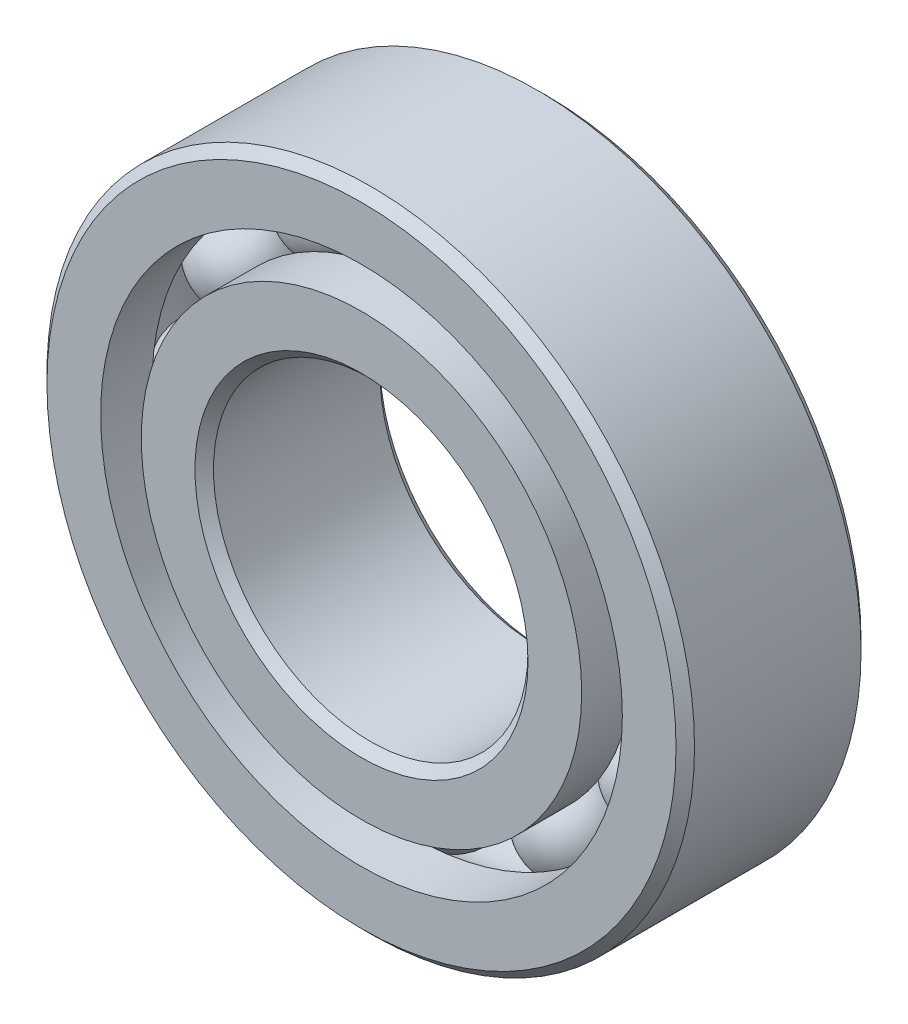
ISO-10303-21;
HEADER;
FILE_DESCRIPTION(('STEP AP214'),'2;1');
FILE_NAME('part.step','',(''),(''),'','','');
FILE_SCHEMA(('AUTOMOTIVE_DESIGN { 1 0 10303 214 1 1 1 1 }'));
ENDSEC;
DATA;
#1=APPLICATION_CONTEXT('core data for automotive mechanical design processes');
#2=APPLICATION_PROTOCOL_DEFINITION('international standard','automotive_design',2000,#1);
#3=PRODUCT_CONTEXT('',#1,'mechanical');
#4=PRODUCT('Part','Part','',(#3));
#5=PRODUCT_RELATED_PRODUCT_CATEGORY('part','',(#4));
#6=PRODUCT_DEFINITION_FORMATION('','',#4);
#7=PRODUCT_DEFINITION_CONTEXT('part definition',#1,'design');
#8=PRODUCT_DEFINITION('design','',#6,#7);
#9=PRODUCT_DEFINITION_SHAPE('','',#8);
#10=(LENGTH_UNIT() NAMED_UNIT(*) SI_UNIT(.MILLI.,.METRE.));
#11=(NAMED_UNIT(*) PLANE_ANGLE_UNIT() SI_UNIT($,.RADIAN.));
#12=(NAMED_UNIT(*) SI_UNIT($,.STERADIAN.) SOLID_ANGLE_UNIT());
#13=UNCERTAINTY_MEASURE_WITH_UNIT(LENGTH_MEASURE(1.E-05),#10,'distance_accuracy_value','');
#14=(GEOMETRIC_REPRESENTATION_CONTEXT(3) GLOBAL_UNCERTAINTY_ASSIGNED_CONTEXT((#13)) GLOBAL_UNIT_ASSIGNED_CONTEXT((#10,
#11,#12)) REPRESENTATION_CONTEXT('',''));
#15=CARTESIAN_POINT('',(0.,0.,0.));
#16=DIRECTION('',(0.,0.,1.));
#17=DIRECTION('',(1.,0.,0.));
#18=AXIS2_PLACEMENT_3D('',#15,#16,#17);
#19=CARTESIAN_POINT('',(-6.49999999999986,11.2583302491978,0.));
#20=DIRECTION('',(0.,0.,1.));
#21=DIRECTION('',(-0.499999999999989,0.866025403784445,0.));
#22=AXIS2_PLACEMENT_3D('',#19,#20,#21);
#23=SPHERICAL_SURFACE('',#22,2.47908354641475);
#24=CARTESIAN_POINT('',(-6.49999999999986,11.2583302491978,2.47908354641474));
#25=VERTEX_POINT('',#24);
#26=VERTEX_LOOP('',#25);
#27=FACE_BOUND('',#26,.T.);
#28=ADVANCED_FACE('F37',(#27),#23,.T.);
#29=CLOSED_SHELL('',(#28));
#30=MANIFOLD_SOLID_BREP('B2',#29);
#31=CARTESIAN_POINT('',(-11.2583302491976,6.50000000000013,0.));
#32=DIRECTION('',(0.,0.,1.));
#33=DIRECTION('',(-0.866025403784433,0.50000000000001,0.));
#34=AXIS2_PLACEMENT_3D('',#31,#32,#33);
#35=SPHERICAL_SURFACE('',#34,2.47908354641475);
#36=CARTESIAN_POINT('',(-11.2583302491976,6.50000000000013,2.47908354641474));
#37=VERTEX_POINT('',#36);
#38=VERTEX_LOOP('',#37);
#39=FACE_BOUND('',#38,.T.);
#40=ADVANCED_FACE('F57',(#39),#35,.T.);
#41=CLOSED_SHELL('',(#40));
#42=MANIFOLD_SOLID_BREP('B6',#41);
#43=CARTESIAN_POINT('',(-13.,1.36167772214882E-13,0.));
#44=DIRECTION('',(0.,0.,1.));
#45=DIRECTION('',(-1.,0.,0.));
#46=AXIS2_PLACEMENT_3D('',#43,#44,#45);
#47=SPHERICAL_SURFACE('',#46,2.47908354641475);
#48=CARTESIAN_POINT('',(-13.,1.36167772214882E-13,2.47908354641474));
#49=VERTEX_POINT('',#48);
#50=VERTEX_LOOP('',#49);
#51=FACE_BOUND('',#50,.T.);
#52=ADVANCED_FACE('F77',(#51),#47,.T.);
#53=CLOSED_SHELL('',(#52));
#54=MANIFOLD_SOLID_BREP('B33',#53);
#55=CARTESIAN_POINT('',(-11.2583302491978,-6.4999999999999,0.));
#56=DIRECTION('',(0.,0.,1.));
#57=DIRECTION('',(-0.866025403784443,-0.499999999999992,0.));
#58=AXIS2_PLACEMENT_3D('',#55,#56,#57);
#59=SPHERICAL_SURFACE('',#58,2.47908354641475);
#60=CARTESIAN_POINT('',(-11.2583302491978,-6.4999999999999,2.47908354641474));
#61=VERTEX_POINT('',#60);
#62=VERTEX_LOOP('',#61);
#63=FACE_BOUND('',#62,.T.);
#64=ADVANCED_FACE('F97',(#63),#59,.T.);
#65=CLOSED_SHELL('',(#64));
#66=MANIFOLD_SOLID_BREP('B53',#65);
#67=CARTESIAN_POINT('',(-6.50000000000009,-11.2583302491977,0.));
#68=DIRECTION('',(0.,0.,1.));
#69=DIRECTION('',(-0.500000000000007,-0.866025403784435,0.));
#70=AXIS2_PLACEMENT_3D('',#67,#68,#69);
#71=SPHERICAL_SURFACE('',#70,2.47908354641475);
#72=CARTESIAN_POINT('',(-6.50000000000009,-11.2583302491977,2.47908354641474));
#73=VERTEX_POINT('',#72);
#74=VERTEX_LOOP('',#73);
#75=FACE_BOUND('',#74,.T.);
#76=ADVANCED_FACE('F117',(#75),#71,.T.);
#77=CLOSED_SHELL('',(#76));
#78=MANIFOLD_SOLID_BREP('B73',#77);
#79=CARTESIAN_POINT('',(0.,-13.,0.));
#80=DIRECTION('',(0.,0.,1.));
#81=DIRECTION('',(0.,-1.,0.));
#82=AXIS2_PLACEMENT_3D('',#79,#80,#81);
#83=SPHERICAL_SURFACE('',#82,2.47908354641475);
#84=CARTESIAN_POINT('',(0.,-13.,2.47908354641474));
#85=VERTEX_POINT('',#84);
#86=VERTEX_LOOP('',#85);
#87=FACE_BOUND('',#86,.T.);
#88=ADVANCED_FACE('F137',(#87),#83,.T.);
#89=CLOSED_SHELL('',(#88));
#90=MANIFOLD_SOLID_BREP('B93',#89);
#91=CARTESIAN_POINT('',(6.49999999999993,-11.2583302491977,0.));
#92=DIRECTION('',(0.,0.,1.));
#93=DIRECTION('',(0.499999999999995,-0.866025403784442,0.));
#94=AXIS2_PLACEMENT_3D('',#91,#92,#93);
#95=SPHERICAL_SURFACE('',#94,2.47908354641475);
#96=CARTESIAN_POINT('',(6.49999999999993,-11.2583302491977,2.47908354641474));
#97=VERTEX_POINT('',#96);
#98=VERTEX_LOOP('',#97);
#99=FACE_BOUND('',#98,.T.);
#100=ADVANCED_FACE('F157',(#99),#95,.T.);
#101=CLOSED_SHELL('',(#100));
#102=MANIFOLD_SOLID_BREP('B113',#101);
#103=CARTESIAN_POINT('',(11.2583302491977,-6.50000000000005,0.));
#104=DIRECTION('',(0.,0.,1.));
#105=DIRECTION('',(0.866025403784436,-0.500000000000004,0.));
#106=AXIS2_PLACEMENT_3D('',#103,#104,#105);
#107=SPHERICAL_SURFACE('',#106,2.47908354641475);
#108=CARTESIAN_POINT('',(11.2583302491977,-6.50000000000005,2.47908354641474));
#109=VERTEX_POINT('',#108);
#110=VERTEX_LOOP('',#109);
#111=FACE_BOUND('',#110,.T.);
#112=ADVANCED_FACE('F177',(#111),#107,.T.);
#113=CLOSED_SHELL('',(#112));
#114=MANIFOLD_SOLID_BREP('B133',#113);
#115=CARTESIAN_POINT('',(13.,0.,0.));
#116=DIRECTION('',(0.,0.,1.));
#117=DIRECTION('',(1.,0.,0.));
#118=AXIS2_PLACEMENT_3D('',#115,#116,#117);
#119=SPHERICAL_SURFACE('',#118,2.47908354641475);
#120=CARTESIAN_POINT('',(13.,0.,2.47908354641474));
#121=VERTEX_POINT('',#120);
#122=VERTEX_LOOP('',#121);
#123=FACE_BOUND('',#122,.T.);
#124=ADVANCED_FACE('F197',(#123),#119,.T.);
#125=CLOSED_SHELL('',(#124));
#126=MANIFOLD_SOLID_BREP('B153',#125);
#127=CARTESIAN_POINT('',(11.2583302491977,6.49999999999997,0.));
#128=DIRECTION('',(0.,0.,1.));
#129=DIRECTION('',(0.86602540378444,0.499999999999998,0.));
#130=AXIS2_PLACEMENT_3D('',#127,#128,#129);
#131=SPHERICAL_SURFACE('',#130,2.47908354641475);
#132=CARTESIAN_POINT('',(11.2583302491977,6.49999999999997,2.47908354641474));
#133=VERTEX_POINT('',#132);
#134=VERTEX_LOOP('',#133);
#135=FACE_BOUND('',#134,.T.);
#136=ADVANCED_FACE('F217',(#135),#131,.T.);
#137=CLOSED_SHELL('',(#136));
#138=MANIFOLD_SOLID_BREP('B173',#137);
#139=CARTESIAN_POINT('',(6.50000000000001,11.2583302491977,0.));
#140=DIRECTION('',(0.,0.,1.));
#141=DIRECTION('',(0.500000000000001,0.866025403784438,0.));
#142=AXIS2_PLACEMENT_3D('',#139,#140,#141);
#143=SPHERICAL_SURFACE('',#142,2.47908354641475);
#144=CARTESIAN_POINT('',(6.50000000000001,11.2583302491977,2.47908354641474));
#145=VERTEX_POINT('',#144);
#146=VERTEX_LOOP('',#145);
#147=FACE_BOUND('',#146,.T.);
#148=ADVANCED_FACE('F237',(#147),#143,.T.);
#149=CLOSED_SHELL('',(#148));
#150=MANIFOLD_SOLID_BREP('B193',#149);
#151=CARTESIAN_POINT('',(0.,13.,0.));
#152=DIRECTION('',(0.,0.,1.));
#153=DIRECTION('',(0.,1.,0.));
#154=AXIS2_PLACEMENT_3D('',#151,#152,#153);
#155=SPHERICAL_SURFACE('',#154,2.47908354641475);
#156=CARTESIAN_POINT('',(0.,13.,2.47908354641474));
#157=VERTEX_POINT('',#156);
#158=VERTEX_LOOP('',#157);
#159=FACE_BOUND('',#158,.T.);
#160=ADVANCED_FACE('F259',(#159),#155,.T.);
#161=CLOSED_SHELL('',(#160));
#162=MANIFOLD_SOLID_BREP('B213',#161);
#163=CARTESIAN_POINT('',(0.,11.9010989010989,5.));
#164=DIRECTION('',(0.,0.,-1.));
#165=DIRECTION('',(-1.,0.,0.));
#166=AXIS2_PLACEMENT_3D('',#163,#164,#165);
#167=PLANE('',#166);
#168=CARTESIAN_POINT('',(0.,0.,5.));
#169=DIRECTION('',(0.,0.,1.));
#170=DIRECTION('',(1.,0.,0.));
#171=AXIS2_PLACEMENT_3D('',#168,#169,#170);
#172=CIRCLE('',#171,9.);
#173=CARTESIAN_POINT('',(9.,0.,5.));
#174=VERTEX_POINT('',#173);
#175=EDGE_CURVE('E306',#174,#174,#172,.T.);
#176=ORIENTED_EDGE('',*,*,#175,.F.);
#177=EDGE_LOOP('',(#176));
#178=FACE_BOUND('',#177,.T.);
#179=CARTESIAN_POINT('',(0.,0.,5.));
#180=DIRECTION('',(0.,0.,1.));
#181=DIRECTION('',(1.,0.,0.));
#182=AXIS2_PLACEMENT_3D('',#179,#180,#181);
#183=CIRCLE('',#182,11.9010989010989);
#184=CARTESIAN_POINT('',(11.9010989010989,0.,5.));
#185=VERTEX_POINT('',#184);
#186=EDGE_CURVE('E258',#185,#185,#183,.T.);
#187=ORIENTED_EDGE('',*,*,#186,.T.);
#188=EDGE_LOOP('',(#187));
#189=FACE_BOUND('',#188,.T.);
#190=ADVANCED_FACE('F278',(#178,#189),#167,.F.);
#191=CARTESIAN_POINT('',(0.,0.,5.));
#192=DIRECTION('',(0.,0.,1.));
#193=DIRECTION('',(1.,0.,0.));
#194=AXIS2_PLACEMENT_3D('',#191,#192,#193);
#195=CYLINDRICAL_SURFACE('',#194,11.9010989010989);
#196=ORIENTED_EDGE('',*,*,#186,.F.);
#197=EDGE_LOOP('',(#196));
#198=FACE_BOUND('',#197,.T.);
#199=CARTESIAN_POINT('',(0.,0.,2.22222222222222));
#200=DIRECTION('',(0.,0.,1.));
#201=DIRECTION('',(1.,0.,0.));
#202=AXIS2_PLACEMENT_3D('',#199,#200,#201);
#203=CIRCLE('',#202,11.9010989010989);
#204=CARTESIAN_POINT('',(11.9010989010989,0.,2.22222222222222));
#205=VERTEX_POINT('',#204);
#206=EDGE_CURVE('E284',#205,#205,#203,.T.);
#207=ORIENTED_EDGE('',*,*,#206,.T.);
#208=EDGE_LOOP('',(#207));
#209=FACE_BOUND('',#208,.T.);
#210=ADVANCED_FACE('F313',(#198,#209),#195,.T.);
#211=CARTESIAN_POINT('',(0.,0.,0.));
#212=DIRECTION('',(0.,0.,1.));
#213=DIRECTION('',(1.,0.,0.));
#214=AXIS2_PLACEMENT_3D('',#211,#212,#213);
#215=TOROIDAL_SURFACE('',#214,13.,2.47908354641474);
#216=ORIENTED_EDGE('',*,*,#206,.F.);
#217=EDGE_LOOP('',(#216));
#218=FACE_BOUND('',#217,.T.);
#219=CARTESIAN_POINT('',(0.,0.,-2.22222222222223));
#220=DIRECTION('',(0.,0.,1.));
#221=DIRECTION('',(1.,0.,0.));
#222=AXIS2_PLACEMENT_3D('',#219,#220,#221);
#223=CIRCLE('',#222,11.9010989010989);
#224=CARTESIAN_POINT('',(11.9010989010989,0.,-2.22222222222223));
#225=VERTEX_POINT('',#224);
#226=EDGE_CURVE('E288',#225,#225,#223,.T.);
#227=ORIENTED_EDGE('',*,*,#226,.T.);
#228=EDGE_LOOP('',(#227));
#229=FACE_BOUND('',#228,.T.);
#230=ADVANCED_FACE('F317',(#218,#229),#215,.F.);
#231=CARTESIAN_POINT('',(0.,0.,5.));
#232=DIRECTION('',(0.,0.,1.));
#233=DIRECTION('',(1.,0.,0.));
#234=AXIS2_PLACEMENT_3D('',#231,#232,#233);
#235=CYLINDRICAL_SURFACE('',#234,11.9010989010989);
#236=ORIENTED_EDGE('',*,*,#226,.F.);
#237=EDGE_LOOP('',(#236));
#238=FACE_BOUND('',#237,.T.);
#239=CARTESIAN_POINT('',(0.,0.,-5.));
#240=DIRECTION('',(0.,0.,1.));
#241=DIRECTION('',(1.,0.,0.));
#242=AXIS2_PLACEMENT_3D('',#239,#240,#241);
#243=CIRCLE('',#242,11.9010989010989);
#244=CARTESIAN_POINT('',(11.9010989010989,0.,-5.));
#245=VERTEX_POINT('',#244);
#246=EDGE_CURVE('E292',#245,#245,#243,.T.);
#247=ORIENTED_EDGE('',*,*,#246,.T.);
#248=EDGE_LOOP('',(#247));
#249=FACE_BOUND('',#248,.T.);
#250=ADVANCED_FACE('F322',(#238,#249),#235,.T.);
#251=CARTESIAN_POINT('',(0.,9.,-5.));
#252=DIRECTION('',(0.,0.,1.));
#253=DIRECTION('',(1.,0.,0.));
#254=AXIS2_PLACEMENT_3D('',#251,#252,#253);
#255=PLANE('',#254);
#256=ORIENTED_EDGE('',*,*,#246,.F.);
#257=EDGE_LOOP('',(#256));
#258=FACE_BOUND('',#257,.T.);
#259=CARTESIAN_POINT('',(0.,0.,-5.));
#260=DIRECTION('',(0.,0.,1.));
#261=DIRECTION('',(1.,0.,0.));
#262=AXIS2_PLACEMENT_3D('',#259,#260,#261);
#263=CIRCLE('',#262,9.);
#264=CARTESIAN_POINT('',(9.,0.,-5.));
#265=VERTEX_POINT('',#264);
#266=EDGE_CURVE('E297',#265,#265,#263,.T.);
#267=ORIENTED_EDGE('',*,*,#266,.T.);
#268=EDGE_LOOP('',(#267));
#269=FACE_BOUND('',#268,.T.);
#270=ADVANCED_FACE('F328',(#258,#269),#255,.F.);
#271=CARTESIAN_POINT('',(0.,0.,-4.5));
#272=DIRECTION('',(0.,0.,-1.));
#273=DIRECTION('',(-1.,0.,0.));
#274=AXIS2_PLACEMENT_3D('',#271,#272,#273);
#275=CONICAL_SURFACE('',#274,8.5,0.785398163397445);
#276=ORIENTED_EDGE('',*,*,#266,.F.);
#277=EDGE_LOOP('',(#276));
#278=FACE_BOUND('',#277,.T.);
#279=CARTESIAN_POINT('',(0.,0.,-4.5));
#280=DIRECTION('',(0.,0.,1.));
#281=DIRECTION('',(1.,0.,0.));
#282=AXIS2_PLACEMENT_3D('',#279,#280,#281);
#283=CIRCLE('',#282,8.5);
#284=CARTESIAN_POINT('',(8.5,0.,-4.5));
#285=VERTEX_POINT('',#284);
#286=EDGE_CURVE('E300',#285,#285,#283,.T.);
#287=ORIENTED_EDGE('',*,*,#286,.T.);
#288=EDGE_LOOP('',(#287));
#289=FACE_BOUND('',#288,.T.);
#290=ADVANCED_FACE('F332',(#278,#289),#275,.F.);
#291=CARTESIAN_POINT('',(0.,0.,5.));
#292=DIRECTION('',(0.,0.,1.));
#293=DIRECTION('',(1.,0.,0.));
#294=AXIS2_PLACEMENT_3D('',#291,#292,#293);
#295=CYLINDRICAL_SURFACE('',#294,8.5);
#296=ORIENTED_EDGE('',*,*,#286,.F.);
#297=EDGE_LOOP('',(#296));
#298=FACE_BOUND('',#297,.T.);
#299=CARTESIAN_POINT('',(0.,0.,4.50000000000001));
#300=DIRECTION('',(0.,0.,1.));
#301=DIRECTION('',(1.,0.,0.));
#302=AXIS2_PLACEMENT_3D('',#299,#300,#301);
#303=CIRCLE('',#302,8.5);
#304=CARTESIAN_POINT('',(8.5,0.,4.50000000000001));
#305=VERTEX_POINT('',#304);
#306=EDGE_CURVE('E303',#305,#305,#303,.T.);
#307=ORIENTED_EDGE('',*,*,#306,.T.);
#308=EDGE_LOOP('',(#307));
#309=FACE_BOUND('',#308,.T.);
#310=ADVANCED_FACE('F336',(#298,#309),#295,.F.);
#311=CARTESIAN_POINT('',(0.,0.,5.));
#312=DIRECTION('',(0.,0.,1.));
#313=DIRECTION('',(1.,0.,0.));
#314=AXIS2_PLACEMENT_3D('',#311,#312,#313);
#315=CONICAL_SURFACE('',#314,9.,0.785398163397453);
#316=ORIENTED_EDGE('',*,*,#306,.F.);
#317=EDGE_LOOP('',(#316));
#318=FACE_BOUND('',#317,.T.);
#319=ORIENTED_EDGE('',*,*,#175,.T.);
#320=EDGE_LOOP('',(#319));
#321=FACE_BOUND('',#320,.T.);
#322=ADVANCED_FACE('F310',(#318,#321),#315,.F.);
#323=CLOSED_SHELL('',(#190,#210,#230,#250,#270,#290,#310,#322));
#324=MANIFOLD_SOLID_BREP('B233',#323);
#325=CARTESIAN_POINT('',(0.,0.,4.5));
#326=DIRECTION('',(0.,0.,-1.));
#327=DIRECTION('',(-1.,0.,0.));
#328=AXIS2_PLACEMENT_3D('',#325,#326,#327);
#329=CONICAL_SURFACE('',#328,17.5,0.785398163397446);
#330=CARTESIAN_POINT('',(0.,0.,5.));
#331=DIRECTION('',(0.,0.,1.));
#332=DIRECTION('',(1.,0.,0.));
#333=AXIS2_PLACEMENT_3D('',#330,#331,#332);
#334=CIRCLE('',#333,17.);
#335=CARTESIAN_POINT('',(17.,0.,5.));
#336=VERTEX_POINT('',#335);
#337=EDGE_CURVE('E427',#336,#336,#334,.T.);
#338=ORIENTED_EDGE('',*,*,#337,.F.);
#339=EDGE_LOOP('',(#338));
#340=FACE_BOUND('',#339,.T.);
#341=CARTESIAN_POINT('',(0.,0.,4.5));
#342=DIRECTION('',(0.,0.,1.));
#343=DIRECTION('',(1.,0.,0.));
#344=AXIS2_PLACEMENT_3D('',#341,#342,#343);
#345=CIRCLE('',#344,17.5);
#346=CARTESIAN_POINT('',(17.5,0.,4.5));
#347=VERTEX_POINT('',#346);
#348=EDGE_CURVE('E277',#347,#347,#345,.T.);
#349=ORIENTED_EDGE('',*,*,#348,.T.);
#350=EDGE_LOOP('',(#349));
#351=FACE_BOUND('',#350,.T.);
#352=ADVANCED_FACE('F399',(#340,#351),#329,.T.);
#353=CARTESIAN_POINT('',(0.,0.,5.));
#354=DIRECTION('',(0.,0.,1.));
#355=DIRECTION('',(1.,0.,0.));
#356=AXIS2_PLACEMENT_3D('',#353,#354,#355);
#357=CYLINDRICAL_SURFACE('',#356,17.5);
#358=ORIENTED_EDGE('',*,*,#348,.F.);
#359=EDGE_LOOP('',(#358));
#360=FACE_BOUND('',#359,.T.);
#361=CARTESIAN_POINT('',(0.,0.,-4.5));
#362=DIRECTION('',(0.,0.,1.));
#363=DIRECTION('',(1.,0.,0.));
#364=AXIS2_PLACEMENT_3D('',#361,#362,#363);
#365=CIRCLE('',#364,17.5);
#366=CARTESIAN_POINT('',(17.5,0.,-4.5));
#367=VERTEX_POINT('',#366);
#368=EDGE_CURVE('E405',#367,#367,#365,.T.);
#369=ORIENTED_EDGE('',*,*,#368,.T.);
#370=EDGE_LOOP('',(#369));
#371=FACE_BOUND('',#370,.T.);
#372=ADVANCED_FACE('F434',(#360,#371),#357,.T.);
#373=CARTESIAN_POINT('',(0.,0.,-5.));
#374=DIRECTION('',(0.,0.,1.));
#375=DIRECTION('',(1.,0.,0.));
#376=AXIS2_PLACEMENT_3D('',#373,#374,#375);
#377=CONICAL_SURFACE('',#376,17.,0.785398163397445);
#378=ORIENTED_EDGE('',*,*,#368,.F.);
#379=EDGE_LOOP('',(#378));
#380=FACE_BOUND('',#379,.T.);
#381=CARTESIAN_POINT('',(0.,0.,-5.));
#382=DIRECTION('',(0.,0.,1.));
#383=DIRECTION('',(1.,0.,0.));
#384=AXIS2_PLACEMENT_3D('',#381,#382,#383);
#385=CIRCLE('',#384,17.);
#386=CARTESIAN_POINT('',(17.,0.,-5.));
#387=VERTEX_POINT('',#386);
#388=EDGE_CURVE('E409',#387,#387,#385,.T.);
#389=ORIENTED_EDGE('',*,*,#388,.T.);
#390=EDGE_LOOP('',(#389));
#391=FACE_BOUND('',#390,.T.);
#392=ADVANCED_FACE('F438',(#380,#391),#377,.T.);
#393=CARTESIAN_POINT('',(0.,17.,-5.));
#394=DIRECTION('',(0.,0.,1.));
#395=DIRECTION('',(1.,0.,0.));
#396=AXIS2_PLACEMENT_3D('',#393,#394,#395);
#397=PLANE('',#396);
#398=ORIENTED_EDGE('',*,*,#388,.F.);
#399=EDGE_LOOP('',(#398));
#400=FACE_BOUND('',#399,.T.);
#401=CARTESIAN_POINT('',(0.,0.,-5.));
#402=DIRECTION('',(0.,0.,1.));
#403=DIRECTION('',(1.,0.,0.));
#404=AXIS2_PLACEMENT_3D('',#401,#402,#403);
#405=CIRCLE('',#404,14.0989010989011);
#406=CARTESIAN_POINT('',(14.0989010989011,0.,-5.));
#407=VERTEX_POINT('',#406);
#408=EDGE_CURVE('E413',#407,#407,#405,.T.);
#409=ORIENTED_EDGE('',*,*,#408,.T.);
#410=EDGE_LOOP('',(#409));
#411=FACE_BOUND('',#410,.T.);
#412=ADVANCED_FACE('F443',(#400,#411),#397,.F.);
#413=CARTESIAN_POINT('',(0.,0.,5.));
#414=DIRECTION('',(0.,0.,1.));
#415=DIRECTION('',(1.,0.,0.));
#416=AXIS2_PLACEMENT_3D('',#413,#414,#415);
#417=CYLINDRICAL_SURFACE('',#416,14.0989010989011);
#418=ORIENTED_EDGE('',*,*,#408,.F.);
#419=EDGE_LOOP('',(#418));
#420=FACE_BOUND('',#419,.T.);
#421=CARTESIAN_POINT('',(0.,0.,-2.22222222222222));
#422=DIRECTION('',(0.,0.,1.));
#423=DIRECTION('',(1.,0.,0.));
#424=AXIS2_PLACEMENT_3D('',#421,#422,#423);
#425=CIRCLE('',#424,14.0989010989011);
#426=CARTESIAN_POINT('',(14.0989010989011,0.,-2.22222222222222));
#427=VERTEX_POINT('',#426);
#428=EDGE_CURVE('E418',#427,#427,#425,.T.);
#429=ORIENTED_EDGE('',*,*,#428,.T.);
#430=EDGE_LOOP('',(#429));
#431=FACE_BOUND('',#430,.T.);
#432=ADVANCED_FACE('F449',(#420,#431),#417,.F.);
#433=CARTESIAN_POINT('',(0.,0.,0.));
#434=DIRECTION('',(0.,0.,1.));
#435=DIRECTION('',(1.,0.,0.));
#436=AXIS2_PLACEMENT_3D('',#433,#434,#435);
#437=TOROIDAL_SURFACE('',#436,13.,2.47908354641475);
#438=ORIENTED_EDGE('',*,*,#428,.F.);
#439=EDGE_LOOP('',(#438));
#440=FACE_BOUND('',#439,.T.);
#441=CARTESIAN_POINT('',(0.,0.,2.22222222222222));
#442=DIRECTION('',(0.,0.,1.));
#443=DIRECTION('',(1.,0.,0.));
#444=AXIS2_PLACEMENT_3D('',#441,#442,#443);
#445=CIRCLE('',#444,14.0989010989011);
#446=CARTESIAN_POINT('',(14.0989010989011,0.,2.22222222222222));
#447=VERTEX_POINT('',#446);
#448=EDGE_CURVE('E421',#447,#447,#445,.T.);
#449=ORIENTED_EDGE('',*,*,#448,.T.);
#450=EDGE_LOOP('',(#449));
#451=FACE_BOUND('',#450,.T.);
#452=ADVANCED_FACE('F453',(#440,#451),#437,.F.);
#453=CARTESIAN_POINT('',(0.,0.,5.));
#454=DIRECTION('',(0.,0.,1.));
#455=DIRECTION('',(1.,0.,0.));
#456=AXIS2_PLACEMENT_3D('',#453,#454,#455);
#457=CYLINDRICAL_SURFACE('',#456,14.0989010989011);
#458=ORIENTED_EDGE('',*,*,#448,.F.);
#459=EDGE_LOOP('',(#458));
#460=FACE_BOUND('',#459,.T.);
#461=CARTESIAN_POINT('',(0.,0.,5.));
#462=DIRECTION('',(0.,0.,1.));
#463=DIRECTION('',(1.,0.,0.));
#464=AXIS2_PLACEMENT_3D('',#461,#462,#463);
#465=CIRCLE('',#464,14.0989010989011);
#466=CARTESIAN_POINT('',(14.0989010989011,0.,5.));
#467=VERTEX_POINT('',#466);
#468=EDGE_CURVE('E424',#467,#467,#465,.T.);
#469=ORIENTED_EDGE('',*,*,#468,.T.);
#470=EDGE_LOOP('',(#469));
#471=FACE_BOUND('',#470,.T.);
#472=ADVANCED_FACE('F457',(#460,#471),#457,.F.);
#473=CARTESIAN_POINT('',(0.,17.,5.));
#474=DIRECTION('',(0.,0.,-1.));
#475=DIRECTION('',(-1.,0.,0.));
#476=AXIS2_PLACEMENT_3D('',#473,#474,#475);
#477=PLANE('',#476);
#478=ORIENTED_EDGE('',*,*,#468,.F.);
#479=EDGE_LOOP('',(#478));
#480=FACE_BOUND('',#479,.T.);
#481=ORIENTED_EDGE('',*,*,#337,.T.);
#482=EDGE_LOOP('',(#481));
#483=FACE_BOUND('',#482,.T.);
#484=ADVANCED_FACE('F431',(#480,#483),#477,.F.);
#485=CLOSED_SHELL('',(#352,#372,#392,#412,#432,#452,#472,#484));
#486=MANIFOLD_SOLID_BREP('B253',#485);
#487=ADVANCED_BREP_SHAPE_REPRESENTATION('',(#18,#30,#42,#54,#66,#78,#90,#102,#114,#126,#138,
#150,#162,#324,#486),#14);
#488=SHAPE_DEFINITION_REPRESENTATION(#9,#487);
ENDSEC;
END-ISO-10303-21;
